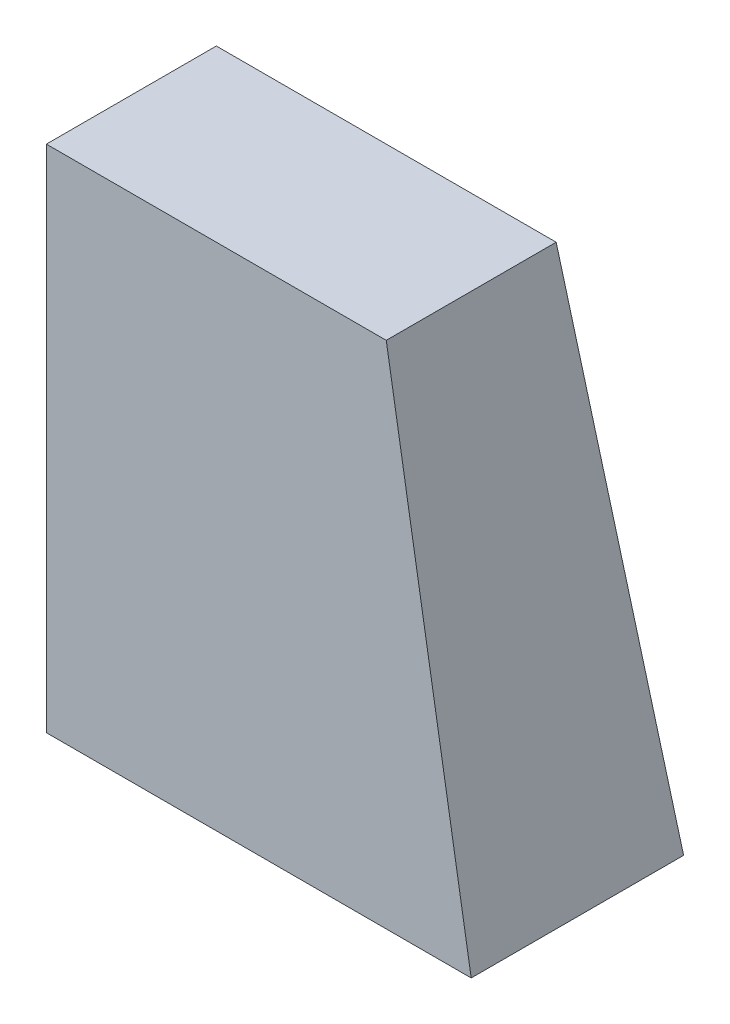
ISO-10303-21;
HEADER;
FILE_DESCRIPTION(('STEP AP214'),'2;1');
FILE_NAME('part.step','',(''),(''),'','','');
FILE_SCHEMA(('AUTOMOTIVE_DESIGN { 1 0 10303 214 1 1 1 1 }'));
ENDSEC;
DATA;
#1=APPLICATION_CONTEXT('core data for automotive mechanical design processes');
#2=APPLICATION_PROTOCOL_DEFINITION('international standard','automotive_design',2000,#1);
#3=PRODUCT_CONTEXT('',#1,'mechanical');
#4=PRODUCT('Part','Part','',(#3));
#5=PRODUCT_RELATED_PRODUCT_CATEGORY('part','',(#4));
#6=PRODUCT_DEFINITION_FORMATION('','',#4);
#7=PRODUCT_DEFINITION_CONTEXT('part definition',#1,'design');
#8=PRODUCT_DEFINITION('design','',#6,#7);
#9=PRODUCT_DEFINITION_SHAPE('','',#8);
#10=(LENGTH_UNIT() NAMED_UNIT(*) SI_UNIT(.MILLI.,.METRE.));
#11=(NAMED_UNIT(*) PLANE_ANGLE_UNIT() SI_UNIT($,.RADIAN.));
#12=(NAMED_UNIT(*) SI_UNIT($,.STERADIAN.) SOLID_ANGLE_UNIT());
#13=UNCERTAINTY_MEASURE_WITH_UNIT(LENGTH_MEASURE(1.E-05),#10,'distance_accuracy_value','');
#14=(GEOMETRIC_REPRESENTATION_CONTEXT(3) GLOBAL_UNCERTAINTY_ASSIGNED_CONTEXT((#13)) GLOBAL_UNIT_ASSIGNED_CONTEXT((#10,
#11,#12)) REPRESENTATION_CONTEXT('',''));
#15=CARTESIAN_POINT('',(0.,0.,0.));
#16=DIRECTION('',(0.,0.,1.));
#17=DIRECTION('',(1.,0.,0.));
#18=AXIS2_PLACEMENT_3D('',#15,#16,#17);
#19=CARTESIAN_POINT('',(0.,152.4,0.));
#20=DIRECTION('',(0.,-1.,0.));
#21=DIRECTION('',(0.,0.,-1.));
#22=AXIS2_PLACEMENT_3D('',#19,#20,#21);
#23=PLANE('',#22);
#24=DIRECTION('',(0.,0.,1.));
#25=VECTOR('',#24,1.);
#26=CARTESIAN_POINT('',(0.,152.4,0.));
#27=LINE('',#26,#25);
#28=CARTESIAN_POINT('',(0.,152.4,-50.8));
#29=VERTEX_POINT('',#28);
#30=CARTESIAN_POINT('',(0.,152.4,0.));
#31=VERTEX_POINT('',#30);
#32=EDGE_CURVE('E91',#29,#31,#27,.T.);
#33=ORIENTED_EDGE('',*,*,#32,.T.);
#34=DIRECTION('',(1.,0.,0.));
#35=VECTOR('',#34,1.);
#36=CARTESIAN_POINT('',(0.,152.4,0.));
#37=LINE('',#36,#35);
#38=CARTESIAN_POINT('',(101.6,152.4,0.));
#39=VERTEX_POINT('',#38);
#40=EDGE_CURVE('E98',#31,#39,#37,.T.);
#41=ORIENTED_EDGE('',*,*,#40,.T.);
#42=DIRECTION('',(0.,0.,-1.));
#43=VECTOR('',#42,1.);
#44=CARTESIAN_POINT('',(101.6,152.4,0.));
#45=LINE('',#44,#43);
#46=CARTESIAN_POINT('',(101.6,152.4,-50.8));
#47=VERTEX_POINT('',#46);
#48=EDGE_CURVE('E104',#39,#47,#45,.T.);
#49=ORIENTED_EDGE('',*,*,#48,.T.);
#50=DIRECTION('',(-1.,0.,0.));
#51=VECTOR('',#50,1.);
#52=CARTESIAN_POINT('',(0.,152.4,-50.8));
#53=LINE('',#52,#51);
#54=EDGE_CURVE('E109',#47,#29,#53,.T.);
#55=ORIENTED_EDGE('',*,*,#54,.T.);
#56=EDGE_LOOP('',(#33,#41,#49,#55));
#57=FACE_BOUND('',#56,.T.);
#58=ADVANCED_FACE('F39',(#57),#23,.F.);
#59=CARTESIAN_POINT('',(0.,0.,-63.5));
#60=DIRECTION('',(0.,-1.,0.));
#61=DIRECTION('',(0.,0.,-1.));
#62=AXIS2_PLACEMENT_3D('',#59,#60,#61);
#63=PLANE('',#62);
#64=DIRECTION('',(0.,0.,1.));
#65=VECTOR('',#64,1.);
#66=CARTESIAN_POINT('',(0.,0.,0.));
#67=LINE('',#66,#65);
#68=CARTESIAN_POINT('',(0.,0.,-63.5));
#69=VERTEX_POINT('',#68);
#70=CARTESIAN_POINT('',(0.,0.,0.));
#71=VERTEX_POINT('',#70);
#72=EDGE_CURVE('E94',#69,#71,#67,.T.);
#73=ORIENTED_EDGE('',*,*,#72,.F.);
#74=DIRECTION('',(-1.,0.,0.));
#75=VECTOR('',#74,1.);
#76=CARTESIAN_POINT('',(0.,0.,-63.5));
#77=LINE('',#76,#75);
#78=CARTESIAN_POINT('',(127.,0.,-63.5));
#79=VERTEX_POINT('',#78);
#80=EDGE_CURVE('E143',#79,#69,#77,.T.);
#81=ORIENTED_EDGE('',*,*,#80,.F.);
#82=DIRECTION('',(0.,0.,-1.));
#83=VECTOR('',#82,1.);
#84=CARTESIAN_POINT('',(127.,0.,0.));
#85=LINE('',#84,#83);
#86=CARTESIAN_POINT('',(127.,0.,0.));
#87=VERTEX_POINT('',#86);
#88=EDGE_CURVE('E51',#87,#79,#85,.T.);
#89=ORIENTED_EDGE('',*,*,#88,.F.);
#90=DIRECTION('',(1.,0.,0.));
#91=VECTOR('',#90,1.);
#92=CARTESIAN_POINT('',(0.,0.,0.));
#93=LINE('',#92,#91);
#94=EDGE_CURVE('E12',#71,#87,#93,.T.);
#95=ORIENTED_EDGE('',*,*,#94,.F.);
#96=EDGE_LOOP('',(#73,#81,#89,#95));
#97=FACE_BOUND('',#96,.T.);
#98=ADVANCED_FACE('F41',(#97),#63,.T.);
#99=CARTESIAN_POINT('',(101.6,152.4,0.));
#100=DIRECTION('',(0.,0.,-1.));
#101=DIRECTION('',(-1.,0.,0.));
#102=AXIS2_PLACEMENT_3D('',#99,#100,#101);
#103=PLANE('',#102);
#104=DIRECTION('',(-0.164398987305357,0.986393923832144,0.));
#105=VECTOR('',#104,1.);
#106=CARTESIAN_POINT('',(127.,0.,0.));
#107=LINE('',#106,#105);
#108=EDGE_CURVE('E59',#87,#39,#107,.T.);
#109=ORIENTED_EDGE('',*,*,#108,.T.);
#110=ORIENTED_EDGE('',*,*,#40,.F.);
#111=DIRECTION('',(0.,1.,0.));
#112=VECTOR('',#111,1.);
#113=CARTESIAN_POINT('',(0.,0.,0.));
#114=LINE('',#113,#112);
#115=EDGE_CURVE('E86',#71,#31,#114,.T.);
#116=ORIENTED_EDGE('',*,*,#115,.F.);
#117=ORIENTED_EDGE('',*,*,#94,.T.);
#118=EDGE_LOOP('',(#109,#110,#116,#117));
#119=FACE_BOUND('',#118,.T.);
#120=ADVANCED_FACE('F100',(#119),#103,.F.);
#121=CARTESIAN_POINT('',(0.,152.4,0.));
#122=DIRECTION('',(1.,0.,0.));
#123=DIRECTION('',(0.,0.,-1.));
#124=AXIS2_PLACEMENT_3D('',#121,#122,#123);
#125=PLANE('',#124);
#126=ORIENTED_EDGE('',*,*,#115,.T.);
#127=ORIENTED_EDGE('',*,*,#32,.F.);
#128=DIRECTION('',(0.,0.99654575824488,0.08304547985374));
#129=VECTOR('',#128,1.);
#130=CARTESIAN_POINT('',(0.,0.,-63.5));
#131=LINE('',#130,#129);
#132=EDGE_CURVE('E103',#69,#29,#131,.T.);
#133=ORIENTED_EDGE('',*,*,#132,.F.);
#134=ORIENTED_EDGE('',*,*,#72,.T.);
#135=EDGE_LOOP('',(#126,#127,#133,#134));
#136=FACE_BOUND('',#135,.T.);
#137=ADVANCED_FACE('F88',(#136),#125,.F.);
#138=CARTESIAN_POINT('',(101.6,152.4,-50.8));
#139=DIRECTION('',(-0.986393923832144,-0.164398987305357,0.));
#140=DIRECTION('',(0.164398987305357,-0.986393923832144,0.));
#141=AXIS2_PLACEMENT_3D('',#138,#139,#140);
#142=PLANE('',#141);
#143=DIRECTION('',(-0.163846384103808,0.983078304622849,0.081923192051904));
#144=VECTOR('',#143,1.);
#145=CARTESIAN_POINT('',(127.,0.,-63.5));
#146=LINE('',#145,#144);
#147=EDGE_CURVE('E159',#79,#47,#146,.T.);
#148=ORIENTED_EDGE('',*,*,#147,.T.);
#149=ORIENTED_EDGE('',*,*,#48,.F.);
#150=ORIENTED_EDGE('',*,*,#108,.F.);
#151=ORIENTED_EDGE('',*,*,#88,.T.);
#152=EDGE_LOOP('',(#148,#149,#150,#151));
#153=FACE_BOUND('',#152,.T.);
#154=ADVANCED_FACE('F180',(#153),#142,.F.);
#155=CARTESIAN_POINT('',(0.,0.,-63.5));
#156=DIRECTION('',(0.,-0.08304547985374,0.99654575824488));
#157=DIRECTION('',(0.,-0.99654575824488,-0.08304547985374));
#158=AXIS2_PLACEMENT_3D('',#155,#156,#157);
#159=PLANE('',#158);
#160=ORIENTED_EDGE('',*,*,#132,.T.);
#161=ORIENTED_EDGE('',*,*,#54,.F.);
#162=ORIENTED_EDGE('',*,*,#147,.F.);
#163=ORIENTED_EDGE('',*,*,#80,.T.);
#164=EDGE_LOOP('',(#160,#161,#162,#163));
#165=FACE_BOUND('',#164,.T.);
#166=ADVANCED_FACE('F157',(#165),#159,.F.);
#167=CLOSED_SHELL('',(#58,#98,#120,#137,#154,#166));
#168=MANIFOLD_SOLID_BREP('B2',#167);
#169=ADVANCED_BREP_SHAPE_REPRESENTATION('',(#18,#168),#14);
#170=SHAPE_DEFINITION_REPRESENTATION(#9,#169);
ENDSEC;
END-ISO-10303-21;
